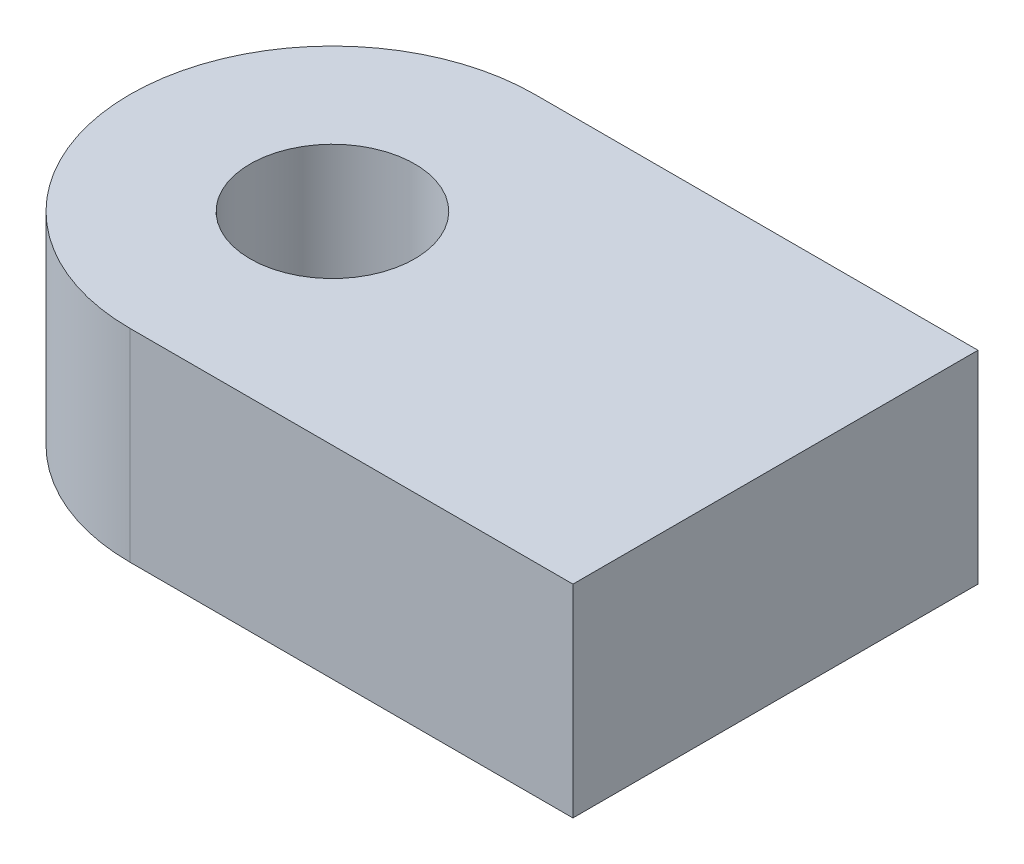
ISO-10303-21;
HEADER;
FILE_DESCRIPTION(('STEP AP214'),'2;1');
FILE_NAME('part.step','',(''),(''),'','','');
FILE_SCHEMA(('AUTOMOTIVE_DESIGN { 1 0 10303 214 1 1 1 1 }'));
ENDSEC;
DATA;
#1=APPLICATION_CONTEXT('core data for automotive mechanical design processes');
#2=APPLICATION_PROTOCOL_DEFINITION('international standard','automotive_design',2000,#1);
#3=PRODUCT_CONTEXT('',#1,'mechanical');
#4=PRODUCT('Part','Part','',(#3));
#5=PRODUCT_RELATED_PRODUCT_CATEGORY('part','',(#4));
#6=PRODUCT_DEFINITION_FORMATION('','',#4);
#7=PRODUCT_DEFINITION_CONTEXT('part definition',#1,'design');
#8=PRODUCT_DEFINITION('design','',#6,#7);
#9=PRODUCT_DEFINITION_SHAPE('','',#8);
#10=(LENGTH_UNIT() NAMED_UNIT(*) SI_UNIT(.MILLI.,.METRE.));
#11=(NAMED_UNIT(*) PLANE_ANGLE_UNIT() SI_UNIT($,.RADIAN.));
#12=(NAMED_UNIT(*) SI_UNIT($,.STERADIAN.) SOLID_ANGLE_UNIT());
#13=UNCERTAINTY_MEASURE_WITH_UNIT(LENGTH_MEASURE(1.E-05),#10,'distance_accuracy_value','');
#14=(GEOMETRIC_REPRESENTATION_CONTEXT(3) GLOBAL_UNCERTAINTY_ASSIGNED_CONTEXT((#13)) GLOBAL_UNIT_ASSIGNED_CONTEXT((#10,
#11,#12)) REPRESENTATION_CONTEXT('',''));
#15=CARTESIAN_POINT('',(0.,0.,0.));
#16=DIRECTION('',(0.,0.,1.));
#17=DIRECTION('',(1.,0.,0.));
#18=AXIS2_PLACEMENT_3D('',#15,#16,#17);
#19=CARTESIAN_POINT('',(35.,16.,-16.));
#20=DIRECTION('',(-1.,0.,0.));
#21=DIRECTION('',(0.,0.,1.));
#22=AXIS2_PLACEMENT_3D('',#19,#20,#21);
#23=PLANE('',#22);
#24=DIRECTION('',(0.,0.,-1.));
#25=VECTOR('',#24,1.);
#26=CARTESIAN_POINT('',(35.,0.,-16.));
#27=LINE('',#26,#25);
#28=CARTESIAN_POINT('',(35.,0.,16.));
#29=VERTEX_POINT('',#28);
#30=CARTESIAN_POINT('',(35.,0.,-16.));
#31=VERTEX_POINT('',#30);
#32=EDGE_CURVE('E95',#29,#31,#27,.T.);
#33=ORIENTED_EDGE('',*,*,#32,.T.);
#34=DIRECTION('',(0.,-1.,0.));
#35=VECTOR('',#34,1.);
#36=CARTESIAN_POINT('',(35.,16.,-16.));
#37=LINE('',#36,#35);
#38=CARTESIAN_POINT('',(35.,16.,-16.));
#39=VERTEX_POINT('',#38);
#40=EDGE_CURVE('E11',#39,#31,#37,.T.);
#41=ORIENTED_EDGE('',*,*,#40,.F.);
#42=DIRECTION('',(0.,0.,-1.));
#43=VECTOR('',#42,1.);
#44=CARTESIAN_POINT('',(35.,16.,-16.));
#45=LINE('',#44,#43);
#46=CARTESIAN_POINT('',(35.,16.,16.));
#47=VERTEX_POINT('',#46);
#48=EDGE_CURVE('E83',#47,#39,#45,.T.);
#49=ORIENTED_EDGE('',*,*,#48,.F.);
#50=DIRECTION('',(0.,-1.,0.));
#51=VECTOR('',#50,1.);
#52=CARTESIAN_POINT('',(35.,16.,16.));
#53=LINE('',#52,#51);
#54=EDGE_CURVE('E91',#47,#29,#53,.T.);
#55=ORIENTED_EDGE('',*,*,#54,.T.);
#56=EDGE_LOOP('',(#33,#41,#49,#55));
#57=FACE_BOUND('',#56,.T.);
#58=ADVANCED_FACE('F32',(#57),#23,.F.);
#59=CARTESIAN_POINT('',(0.,16.,-16.));
#60=DIRECTION('',(0.,0.,1.));
#61=DIRECTION('',(1.,0.,0.));
#62=AXIS2_PLACEMENT_3D('',#59,#60,#61);
#63=PLANE('',#62);
#64=DIRECTION('',(-1.,0.,0.));
#65=VECTOR('',#64,1.);
#66=CARTESIAN_POINT('',(0.,0.,-16.));
#67=LINE('',#66,#65);
#68=CARTESIAN_POINT('',(0.,0.,-16.));
#69=VERTEX_POINT('',#68);
#70=EDGE_CURVE('E87',#31,#69,#67,.T.);
#71=ORIENTED_EDGE('',*,*,#70,.T.);
#72=DIRECTION('',(0.,-1.,0.));
#73=VECTOR('',#72,1.);
#74=CARTESIAN_POINT('',(0.,16.,-16.));
#75=LINE('',#74,#73);
#76=CARTESIAN_POINT('',(0.,16.,-16.));
#77=VERTEX_POINT('',#76);
#78=EDGE_CURVE('E40',#77,#69,#75,.T.);
#79=ORIENTED_EDGE('',*,*,#78,.F.);
#80=DIRECTION('',(-1.,0.,0.));
#81=VECTOR('',#80,1.);
#82=CARTESIAN_POINT('',(0.,16.,-16.));
#83=LINE('',#82,#81);
#84=EDGE_CURVE('E78',#39,#77,#83,.T.);
#85=ORIENTED_EDGE('',*,*,#84,.F.);
#86=ORIENTED_EDGE('',*,*,#40,.T.);
#87=EDGE_LOOP('',(#71,#79,#85,#86));
#88=FACE_BOUND('',#87,.T.);
#89=ADVANCED_FACE('F86',(#88),#63,.F.);
#90=CARTESIAN_POINT('',(0.,16.,0.));
#91=DIRECTION('',(0.,-1.,0.));
#92=DIRECTION('',(0.,0.,-1.));
#93=AXIS2_PLACEMENT_3D('',#90,#91,#92);
#94=CYLINDRICAL_SURFACE('',#93,16.);
#95=CARTESIAN_POINT('',(0.,0.,0.));
#96=DIRECTION('',(0.,1.,0.));
#97=DIRECTION('',(0.,0.,-1.));
#98=AXIS2_PLACEMENT_3D('',#95,#96,#97);
#99=CIRCLE('',#98,16.);
#100=CARTESIAN_POINT('',(0.,0.,16.));
#101=VERTEX_POINT('',#100);
#102=EDGE_CURVE('E65',#69,#101,#99,.T.);
#103=ORIENTED_EDGE('',*,*,#102,.T.);
#104=DIRECTION('',(0.,-1.,0.));
#105=VECTOR('',#104,1.);
#106=CARTESIAN_POINT('',(0.,16.,16.));
#107=LINE('',#106,#105);
#108=CARTESIAN_POINT('',(0.,16.,16.));
#109=VERTEX_POINT('',#108);
#110=EDGE_CURVE('E88',#109,#101,#107,.T.);
#111=ORIENTED_EDGE('',*,*,#110,.F.);
#112=CARTESIAN_POINT('',(0.,16.,0.));
#113=DIRECTION('',(0.,1.,0.));
#114=DIRECTION('',(0.,0.,-1.));
#115=AXIS2_PLACEMENT_3D('',#112,#113,#114);
#116=CIRCLE('',#115,16.);
#117=EDGE_CURVE('E81',#77,#109,#116,.T.);
#118=ORIENTED_EDGE('',*,*,#117,.F.);
#119=ORIENTED_EDGE('',*,*,#78,.T.);
#120=EDGE_LOOP('',(#103,#111,#118,#119));
#121=FACE_BOUND('',#120,.T.);
#122=ADVANCED_FACE('F89',(#121),#94,.T.);
#123=CARTESIAN_POINT('',(35.,16.,16.));
#124=DIRECTION('',(0.,0.,-1.));
#125=DIRECTION('',(-1.,0.,0.));
#126=AXIS2_PLACEMENT_3D('',#123,#124,#125);
#127=PLANE('',#126);
#128=DIRECTION('',(1.,0.,0.));
#129=VECTOR('',#128,1.);
#130=CARTESIAN_POINT('',(35.,0.,16.));
#131=LINE('',#130,#129);
#132=EDGE_CURVE('E71',#101,#29,#131,.T.);
#133=ORIENTED_EDGE('',*,*,#132,.T.);
#134=ORIENTED_EDGE('',*,*,#54,.F.);
#135=DIRECTION('',(1.,0.,0.));
#136=VECTOR('',#135,1.);
#137=CARTESIAN_POINT('',(35.,16.,16.));
#138=LINE('',#137,#136);
#139=EDGE_CURVE('E48',#109,#47,#138,.T.);
#140=ORIENTED_EDGE('',*,*,#139,.F.);
#141=ORIENTED_EDGE('',*,*,#110,.T.);
#142=EDGE_LOOP('',(#133,#134,#140,#141));
#143=FACE_BOUND('',#142,.T.);
#144=ADVANCED_FACE('F103',(#143),#127,.F.);
#145=CARTESIAN_POINT('',(0.,16.,0.));
#146=DIRECTION('',(0.,-1.,0.));
#147=DIRECTION('',(0.,0.,-1.));
#148=AXIS2_PLACEMENT_3D('',#145,#146,#147);
#149=PLANE('',#148);
#150=CARTESIAN_POINT('',(0.,16.,0.));
#151=DIRECTION('',(0.,1.,0.));
#152=DIRECTION('',(0.,0.,1.));
#153=AXIS2_PLACEMENT_3D('',#150,#151,#152);
#154=CIRCLE('',#153,6.5);
#155=CARTESIAN_POINT('',(0.,16.,6.5));
#156=VERTEX_POINT('',#155);
#157=EDGE_CURVE('E109',#156,#156,#154,.T.);
#158=ORIENTED_EDGE('',*,*,#157,.F.);
#159=EDGE_LOOP('',(#158));
#160=FACE_BOUND('',#159,.T.);
#161=ORIENTED_EDGE('',*,*,#48,.T.);
#162=ORIENTED_EDGE('',*,*,#84,.T.);
#163=ORIENTED_EDGE('',*,*,#117,.T.);
#164=ORIENTED_EDGE('',*,*,#139,.T.);
#165=EDGE_LOOP('',(#161,#162,#163,#164));
#166=FACE_BOUND('',#165,.T.);
#167=ADVANCED_FACE('F79',(#160,#166),#149,.F.);
#168=CARTESIAN_POINT('',(0.,0.,0.));
#169=DIRECTION('',(0.,-1.,0.));
#170=DIRECTION('',(0.,0.,-1.));
#171=AXIS2_PLACEMENT_3D('',#168,#169,#170);
#172=PLANE('',#171);
#173=CARTESIAN_POINT('',(0.,0.,0.));
#174=DIRECTION('',(0.,1.,0.));
#175=DIRECTION('',(0.,0.,1.));
#176=AXIS2_PLACEMENT_3D('',#173,#174,#175);
#177=CIRCLE('',#176,6.5);
#178=CARTESIAN_POINT('',(0.,0.,6.5));
#179=VERTEX_POINT('',#178);
#180=EDGE_CURVE('E98',#179,#179,#177,.T.);
#181=ORIENTED_EDGE('',*,*,#180,.T.);
#182=EDGE_LOOP('',(#181));
#183=FACE_BOUND('',#182,.T.);
#184=ORIENTED_EDGE('',*,*,#32,.F.);
#185=ORIENTED_EDGE('',*,*,#132,.F.);
#186=ORIENTED_EDGE('',*,*,#102,.F.);
#187=ORIENTED_EDGE('',*,*,#70,.F.);
#188=EDGE_LOOP('',(#184,#185,#186,#187));
#189=FACE_BOUND('',#188,.T.);
#190=ADVANCED_FACE('F106',(#183,#189),#172,.T.);
#191=CARTESIAN_POINT('',(0.,0.,0.));
#192=DIRECTION('',(0.,1.,0.));
#193=DIRECTION('',(0.,0.,1.));
#194=AXIS2_PLACEMENT_3D('',#191,#192,#193);
#195=CYLINDRICAL_SURFACE('',#194,6.5);
#196=ORIENTED_EDGE('',*,*,#180,.F.);
#197=EDGE_LOOP('',(#196));
#198=FACE_BOUND('',#197,.T.);
#199=ORIENTED_EDGE('',*,*,#157,.T.);
#200=EDGE_LOOP('',(#199));
#201=FACE_BOUND('',#200,.T.);
#202=ADVANCED_FACE('F116',(#198,#201),#195,.F.);
#203=CLOSED_SHELL('',(#58,#89,#122,#144,#167,#190,#202));
#204=MANIFOLD_SOLID_BREP('B2',#203);
#205=ADVANCED_BREP_SHAPE_REPRESENTATION('',(#18,#204),#14);
#206=SHAPE_DEFINITION_REPRESENTATION(#9,#205);
ENDSEC;
END-ISO-10303-21;
